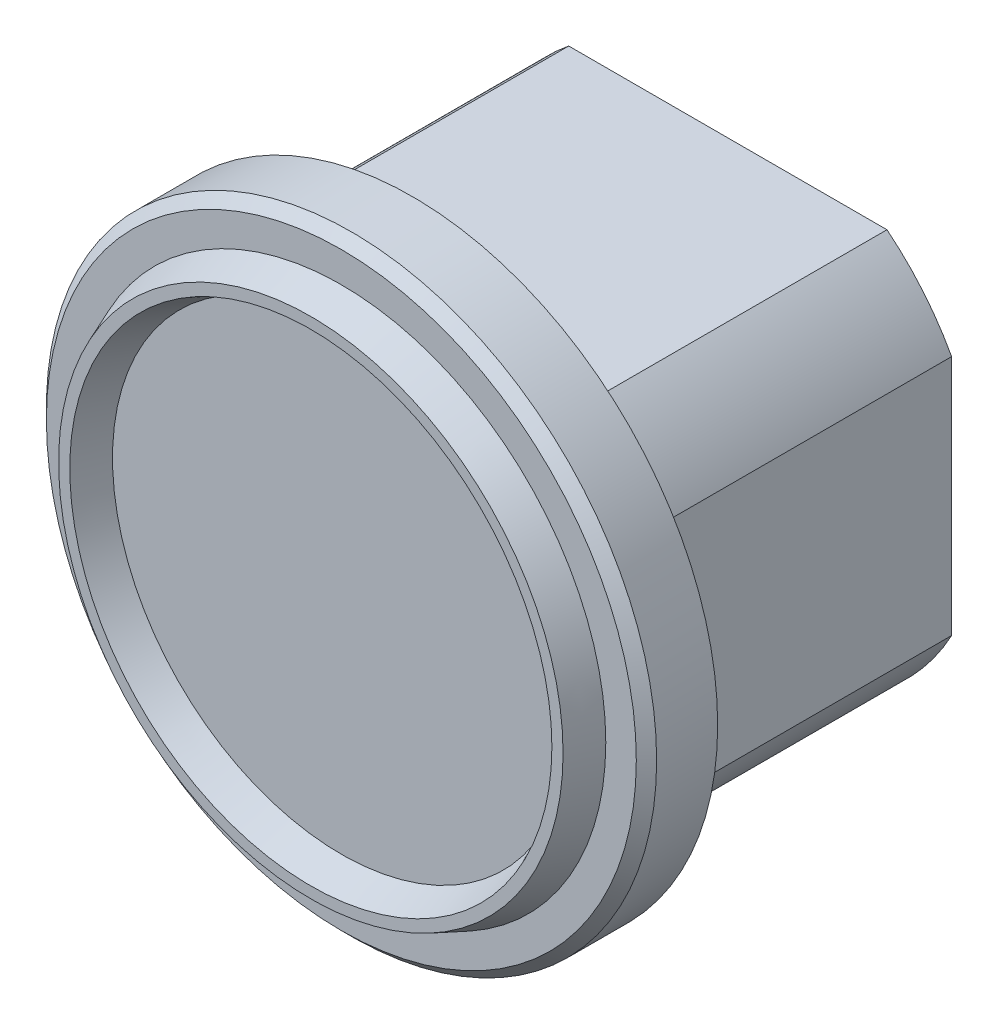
ISO-10303-21;
HEADER;
FILE_DESCRIPTION(('STEP AP214'),'2;1');
FILE_NAME('part.step','',(''),(''),'','','');
FILE_SCHEMA(('AUTOMOTIVE_DESIGN { 1 0 10303 214 1 1 1 1 }'));
ENDSEC;
DATA;
#1=APPLICATION_CONTEXT('core data for automotive mechanical design processes');
#2=APPLICATION_PROTOCOL_DEFINITION('international standard','automotive_design',2000,#1);
#3=PRODUCT_CONTEXT('',#1,'mechanical');
#4=PRODUCT('Part','Part','',(#3));
#5=PRODUCT_RELATED_PRODUCT_CATEGORY('part','',(#4));
#6=PRODUCT_DEFINITION_FORMATION('','',#4);
#7=PRODUCT_DEFINITION_CONTEXT('part definition',#1,'design');
#8=PRODUCT_DEFINITION('design','',#6,#7);
#9=PRODUCT_DEFINITION_SHAPE('','',#8);
#10=(LENGTH_UNIT() NAMED_UNIT(*) SI_UNIT(.MILLI.,.METRE.));
#11=(NAMED_UNIT(*) PLANE_ANGLE_UNIT() SI_UNIT($,.RADIAN.));
#12=(NAMED_UNIT(*) SI_UNIT($,.STERADIAN.) SOLID_ANGLE_UNIT());
#13=UNCERTAINTY_MEASURE_WITH_UNIT(LENGTH_MEASURE(1.E-05),#10,'distance_accuracy_value','');
#14=(GEOMETRIC_REPRESENTATION_CONTEXT(3) GLOBAL_UNCERTAINTY_ASSIGNED_CONTEXT((#13)) GLOBAL_UNIT_ASSIGNED_CONTEXT((#10,
#11,#12)) REPRESENTATION_CONTEXT('',''));
#15=CARTESIAN_POINT('',(0.,0.,0.));
#16=DIRECTION('',(0.,0.,1.));
#17=DIRECTION('',(1.,0.,0.));
#18=AXIS2_PLACEMENT_3D('',#15,#16,#17);
#19=CARTESIAN_POINT('',(22.,19.5,31.));
#20=DIRECTION('',(0.,0.,-1.));
#21=DIRECTION('',(-1.,0.,0.));
#22=AXIS2_PLACEMENT_3D('',#19,#20,#21);
#23=CYLINDRICAL_SURFACE('',#22,25.);
#24=CARTESIAN_POINT('',(22.,19.5,0.));
#25=DIRECTION('',(0.,0.,1.));
#26=DIRECTION('',(1.,0.,0.));
#27=AXIS2_PLACEMENT_3D('',#24,#25,#26);
#28=CIRCLE('',#27,25.);
#29=CARTESIAN_POINT('',(6.35551215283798,39.,0.));
#30=VERTEX_POINT('',#29);
#31=CARTESIAN_POINT('',(0.,31.3743420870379,0.));
#32=VERTEX_POINT('',#31);
#33=EDGE_CURVE('E144',#30,#32,#28,.T.);
#34=ORIENTED_EDGE('',*,*,#33,.T.);
#35=DIRECTION('',(0.,0.,-1.));
#36=VECTOR('',#35,1.);
#37=CARTESIAN_POINT('',(0.,31.3743420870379,31.));
#38=LINE('',#37,#36);
#39=CARTESIAN_POINT('',(0.,31.3743420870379,31.));
#40=VERTEX_POINT('',#39);
#41=EDGE_CURVE('E170',#40,#32,#38,.T.);
#42=ORIENTED_EDGE('',*,*,#41,.F.);
#43=CARTESIAN_POINT('',(22.,19.5,31.));
#44=DIRECTION('',(0.,0.,1.));
#45=DIRECTION('',(1.,0.,0.));
#46=AXIS2_PLACEMENT_3D('',#43,#44,#45);
#47=CIRCLE('',#46,25.);
#48=CARTESIAN_POINT('',(6.35551215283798,39.,31.));
#49=VERTEX_POINT('',#48);
#50=EDGE_CURVE('E159',#49,#40,#47,.T.);
#51=ORIENTED_EDGE('',*,*,#50,.F.);
#52=DIRECTION('',(0.,0.,-1.));
#53=VECTOR('',#52,1.);
#54=CARTESIAN_POINT('',(6.35551215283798,39.,31.));
#55=LINE('',#54,#53);
#56=EDGE_CURVE('E143',#49,#30,#55,.T.);
#57=ORIENTED_EDGE('',*,*,#56,.T.);
#58=EDGE_LOOP('',(#34,#42,#51,#57));
#59=FACE_BOUND('',#58,.T.);
#60=ADVANCED_FACE('F35',(#59),#23,.T.);
#61=CARTESIAN_POINT('',(0.,7.62565791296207,31.));
#62=DIRECTION('',(1.,0.,0.));
#63=DIRECTION('',(0.,0.,-1.));
#64=AXIS2_PLACEMENT_3D('',#61,#62,#63);
#65=PLANE('',#64);
#66=DIRECTION('',(0.,-1.,0.));
#67=VECTOR('',#66,1.);
#68=CARTESIAN_POINT('',(0.,7.62565791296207,0.));
#69=LINE('',#68,#67);
#70=CARTESIAN_POINT('',(0.,7.62565791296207,0.));
#71=VERTEX_POINT('',#70);
#72=EDGE_CURVE('E147',#32,#71,#69,.T.);
#73=ORIENTED_EDGE('',*,*,#72,.T.);
#74=DIRECTION('',(0.,0.,-1.));
#75=VECTOR('',#74,1.);
#76=CARTESIAN_POINT('',(0.,7.62565791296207,31.));
#77=LINE('',#76,#75);
#78=CARTESIAN_POINT('',(0.,7.62565791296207,31.));
#79=VERTEX_POINT('',#78);
#80=EDGE_CURVE('E167',#79,#71,#77,.T.);
#81=ORIENTED_EDGE('',*,*,#80,.F.);
#82=DIRECTION('',(0.,-1.,0.));
#83=VECTOR('',#82,1.);
#84=CARTESIAN_POINT('',(0.,7.62565791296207,31.));
#85=LINE('',#84,#83);
#86=EDGE_CURVE('E95',#40,#79,#85,.T.);
#87=ORIENTED_EDGE('',*,*,#86,.F.);
#88=ORIENTED_EDGE('',*,*,#41,.T.);
#89=EDGE_LOOP('',(#73,#81,#87,#88));
#90=FACE_BOUND('',#89,.T.);
#91=ADVANCED_FACE('F200',(#90),#65,.F.);
#92=CARTESIAN_POINT('',(22.,19.5,31.));
#93=DIRECTION('',(0.,0.,-1.));
#94=DIRECTION('',(-1.,0.,0.));
#95=AXIS2_PLACEMENT_3D('',#92,#93,#94);
#96=CYLINDRICAL_SURFACE('',#95,25.);
#97=CARTESIAN_POINT('',(22.,19.5,0.));
#98=DIRECTION('',(0.,0.,1.));
#99=DIRECTION('',(1.,0.,0.));
#100=AXIS2_PLACEMENT_3D('',#97,#98,#99);
#101=CIRCLE('',#100,25.);
#102=CARTESIAN_POINT('',(6.35551215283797,0.,0.));
#103=VERTEX_POINT('',#102);
#104=EDGE_CURVE('E150',#71,#103,#101,.T.);
#105=ORIENTED_EDGE('',*,*,#104,.T.);
#106=DIRECTION('',(0.,0.,-1.));
#107=VECTOR('',#106,1.);
#108=CARTESIAN_POINT('',(6.35551215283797,0.,31.));
#109=LINE('',#108,#107);
#110=CARTESIAN_POINT('',(6.35551215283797,0.,31.));
#111=VERTEX_POINT('',#110);
#112=EDGE_CURVE('E164',#111,#103,#109,.T.);
#113=ORIENTED_EDGE('',*,*,#112,.F.);
#114=CARTESIAN_POINT('',(22.,19.5,31.));
#115=DIRECTION('',(0.,0.,1.));
#116=DIRECTION('',(1.,0.,0.));
#117=AXIS2_PLACEMENT_3D('',#114,#115,#116);
#118=CIRCLE('',#117,25.);
#119=EDGE_CURVE('E136',#79,#111,#118,.T.);
#120=ORIENTED_EDGE('',*,*,#119,.F.);
#121=ORIENTED_EDGE('',*,*,#80,.T.);
#122=EDGE_LOOP('',(#105,#113,#120,#121));
#123=FACE_BOUND('',#122,.T.);
#124=ADVANCED_FACE('F206',(#123),#96,.T.);
#125=CARTESIAN_POINT('',(6.35551215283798,0.,31.));
#126=DIRECTION('',(0.,1.,0.));
#127=DIRECTION('',(0.,0.,1.));
#128=AXIS2_PLACEMENT_3D('',#125,#126,#127);
#129=PLANE('',#128);
#130=DIRECTION('',(1.,0.,0.));
#131=VECTOR('',#130,1.);
#132=CARTESIAN_POINT('',(6.35551215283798,0.,0.));
#133=LINE('',#132,#131);
#134=CARTESIAN_POINT('',(37.644487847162,0.,0.));
#135=VERTEX_POINT('',#134);
#136=EDGE_CURVE('E152',#103,#135,#133,.T.);
#137=ORIENTED_EDGE('',*,*,#136,.T.);
#138=DIRECTION('',(0.,0.,-1.));
#139=VECTOR('',#138,1.);
#140=CARTESIAN_POINT('',(37.644487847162,0.,31.));
#141=LINE('',#140,#139);
#142=CARTESIAN_POINT('',(37.644487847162,0.,31.));
#143=VERTEX_POINT('',#142);
#144=EDGE_CURVE('E120',#143,#135,#141,.T.);
#145=ORIENTED_EDGE('',*,*,#144,.F.);
#146=DIRECTION('',(1.,0.,0.));
#147=VECTOR('',#146,1.);
#148=CARTESIAN_POINT('',(6.35551215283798,0.,31.));
#149=LINE('',#148,#147);
#150=EDGE_CURVE('E134',#111,#143,#149,.T.);
#151=ORIENTED_EDGE('',*,*,#150,.F.);
#152=ORIENTED_EDGE('',*,*,#112,.T.);
#153=EDGE_LOOP('',(#137,#145,#151,#152));
#154=FACE_BOUND('',#153,.T.);
#155=ADVANCED_FACE('F242',(#154),#129,.F.);
#156=CARTESIAN_POINT('',(22.,19.5,31.));
#157=DIRECTION('',(0.,0.,-1.));
#158=DIRECTION('',(-1.,0.,0.));
#159=AXIS2_PLACEMENT_3D('',#156,#157,#158);
#160=CYLINDRICAL_SURFACE('',#159,25.);
#161=CARTESIAN_POINT('',(22.,19.5,0.));
#162=DIRECTION('',(0.,0.,1.));
#163=DIRECTION('',(1.,0.,0.));
#164=AXIS2_PLACEMENT_3D('',#161,#162,#163);
#165=CIRCLE('',#164,25.);
#166=CARTESIAN_POINT('',(44.,7.62565791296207,0.));
#167=VERTEX_POINT('',#166);
#168=EDGE_CURVE('E117',#135,#167,#165,.T.);
#169=ORIENTED_EDGE('',*,*,#168,.T.);
#170=DIRECTION('',(0.,0.,-1.));
#171=VECTOR('',#170,1.);
#172=CARTESIAN_POINT('',(44.,7.62565791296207,31.));
#173=LINE('',#172,#171);
#174=CARTESIAN_POINT('',(44.,7.62565791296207,31.));
#175=VERTEX_POINT('',#174);
#176=EDGE_CURVE('E109',#175,#167,#173,.T.);
#177=ORIENTED_EDGE('',*,*,#176,.F.);
#178=CARTESIAN_POINT('',(22.,19.5,31.));
#179=DIRECTION('',(0.,0.,1.));
#180=DIRECTION('',(1.,0.,0.));
#181=AXIS2_PLACEMENT_3D('',#178,#179,#180);
#182=CIRCLE('',#181,25.);
#183=EDGE_CURVE('E114',#143,#175,#182,.T.);
#184=ORIENTED_EDGE('',*,*,#183,.F.);
#185=ORIENTED_EDGE('',*,*,#144,.T.);
#186=EDGE_LOOP('',(#169,#177,#184,#185));
#187=FACE_BOUND('',#186,.T.);
#188=ADVANCED_FACE('F111',(#187),#160,.T.);
#189=CARTESIAN_POINT('',(44.,7.62565791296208,31.));
#190=DIRECTION('',(-1.,0.,0.));
#191=DIRECTION('',(0.,0.,1.));
#192=AXIS2_PLACEMENT_3D('',#189,#190,#191);
#193=PLANE('',#192);
#194=DIRECTION('',(0.,1.,0.));
#195=VECTOR('',#194,1.);
#196=CARTESIAN_POINT('',(44.,7.62565791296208,0.));
#197=LINE('',#196,#195);
#198=CARTESIAN_POINT('',(44.,31.3743420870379,0.));
#199=VERTEX_POINT('',#198);
#200=EDGE_CURVE('E155',#167,#199,#197,.T.);
#201=ORIENTED_EDGE('',*,*,#200,.T.);
#202=DIRECTION('',(0.,0.,-1.));
#203=VECTOR('',#202,1.);
#204=CARTESIAN_POINT('',(44.,31.3743420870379,31.));
#205=LINE('',#204,#203);
#206=CARTESIAN_POINT('',(44.,31.3743420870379,31.));
#207=VERTEX_POINT('',#206);
#208=EDGE_CURVE('E121',#207,#199,#205,.T.);
#209=ORIENTED_EDGE('',*,*,#208,.F.);
#210=DIRECTION('',(0.,1.,0.));
#211=VECTOR('',#210,1.);
#212=CARTESIAN_POINT('',(44.,7.62565791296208,31.));
#213=LINE('',#212,#211);
#214=EDGE_CURVE('E124',#175,#207,#213,.T.);
#215=ORIENTED_EDGE('',*,*,#214,.F.);
#216=ORIENTED_EDGE('',*,*,#176,.T.);
#217=EDGE_LOOP('',(#201,#209,#215,#216));
#218=FACE_BOUND('',#217,.T.);
#219=ADVANCED_FACE('F125',(#218),#193,.F.);
#220=CARTESIAN_POINT('',(22.,19.5,31.));
#221=DIRECTION('',(0.,0.,-1.));
#222=DIRECTION('',(-1.,0.,0.));
#223=AXIS2_PLACEMENT_3D('',#220,#221,#222);
#224=CYLINDRICAL_SURFACE('',#223,25.);
#225=CARTESIAN_POINT('',(22.,19.5,0.));
#226=DIRECTION('',(0.,0.,1.));
#227=DIRECTION('',(1.,0.,0.));
#228=AXIS2_PLACEMENT_3D('',#225,#226,#227);
#229=CIRCLE('',#228,25.);
#230=CARTESIAN_POINT('',(37.644487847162,39.,0.));
#231=VERTEX_POINT('',#230);
#232=EDGE_CURVE('E80',#199,#231,#229,.T.);
#233=ORIENTED_EDGE('',*,*,#232,.T.);
#234=DIRECTION('',(0.,0.,-1.));
#235=VECTOR('',#234,1.);
#236=CARTESIAN_POINT('',(37.644487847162,39.,31.));
#237=LINE('',#236,#235);
#238=CARTESIAN_POINT('',(37.644487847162,39.,31.));
#239=VERTEX_POINT('',#238);
#240=EDGE_CURVE('E52',#239,#231,#237,.T.);
#241=ORIENTED_EDGE('',*,*,#240,.F.);
#242=CARTESIAN_POINT('',(22.,19.5,31.));
#243=DIRECTION('',(0.,0.,1.));
#244=DIRECTION('',(1.,0.,0.));
#245=AXIS2_PLACEMENT_3D('',#242,#243,#244);
#246=CIRCLE('',#245,25.);
#247=EDGE_CURVE('E128',#207,#239,#246,.T.);
#248=ORIENTED_EDGE('',*,*,#247,.F.);
#249=ORIENTED_EDGE('',*,*,#208,.T.);
#250=EDGE_LOOP('',(#233,#241,#248,#249));
#251=FACE_BOUND('',#250,.T.);
#252=ADVANCED_FACE('F246',(#251),#224,.T.);
#253=CARTESIAN_POINT('',(6.35551215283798,39.,31.));
#254=DIRECTION('',(0.,-1.,0.));
#255=DIRECTION('',(1.,0.,0.));
#256=AXIS2_PLACEMENT_3D('',#253,#254,#255);
#257=PLANE('',#256);
#258=DIRECTION('',(-1.,0.,0.));
#259=VECTOR('',#258,1.);
#260=CARTESIAN_POINT('',(6.35551215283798,39.,0.));
#261=LINE('',#260,#259);
#262=EDGE_CURVE('E86',#231,#30,#261,.T.);
#263=ORIENTED_EDGE('',*,*,#262,.T.);
#264=ORIENTED_EDGE('',*,*,#56,.F.);
#265=DIRECTION('',(-1.,0.,0.));
#266=VECTOR('',#265,1.);
#267=CARTESIAN_POINT('',(6.35551215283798,39.,31.));
#268=LINE('',#267,#266);
#269=EDGE_CURVE('E141',#239,#49,#268,.T.);
#270=ORIENTED_EDGE('',*,*,#269,.F.);
#271=ORIENTED_EDGE('',*,*,#240,.T.);
#272=EDGE_LOOP('',(#263,#264,#270,#271));
#273=FACE_BOUND('',#272,.T.);
#274=ADVANCED_FACE('F248',(#273),#257,.F.);
#275=CARTESIAN_POINT('',(22.,19.5,0.));
#276=DIRECTION('',(0.,0.,1.));
#277=DIRECTION('',(1.,0.,0.));
#278=AXIS2_PLACEMENT_3D('',#275,#276,#277);
#279=PLANE('',#278);
#280=ORIENTED_EDGE('',*,*,#33,.F.);
#281=ORIENTED_EDGE('',*,*,#262,.F.);
#282=ORIENTED_EDGE('',*,*,#232,.F.);
#283=ORIENTED_EDGE('',*,*,#200,.F.);
#284=ORIENTED_EDGE('',*,*,#168,.F.);
#285=ORIENTED_EDGE('',*,*,#136,.F.);
#286=ORIENTED_EDGE('',*,*,#104,.F.);
#287=ORIENTED_EDGE('',*,*,#72,.F.);
#288=EDGE_LOOP('',(#280,#281,#282,#283,#284,#285,#286,#287));
#289=FACE_BOUND('',#288,.T.);
#290=ADVANCED_FACE('F245',(#289),#279,.F.);
#291=CARTESIAN_POINT('',(22.,19.5,31.));
#292=DIRECTION('',(0.,0.,1.));
#293=DIRECTION('',(1.,0.,0.));
#294=AXIS2_PLACEMENT_3D('',#291,#292,#293);
#295=PLANE('',#294);
#296=CARTESIAN_POINT('',(22.,19.5,31.));
#297=DIRECTION('',(0.,0.,1.));
#298=DIRECTION('',(1.,0.,0.));
#299=AXIS2_PLACEMENT_3D('',#296,#297,#298);
#300=CIRCLE('',#299,30.);
#301=CARTESIAN_POINT('',(52.,19.5,31.));
#302=VERTEX_POINT('',#301);
#303=EDGE_CURVE('E148',#302,#302,#300,.T.);
#304=ORIENTED_EDGE('',*,*,#303,.F.);
#305=EDGE_LOOP('',(#304));
#306=FACE_BOUND('',#305,.T.);
#307=ORIENTED_EDGE('',*,*,#269,.T.);
#308=ORIENTED_EDGE('',*,*,#50,.T.);
#309=ORIENTED_EDGE('',*,*,#86,.T.);
#310=ORIENTED_EDGE('',*,*,#119,.T.);
#311=ORIENTED_EDGE('',*,*,#150,.T.);
#312=ORIENTED_EDGE('',*,*,#183,.T.);
#313=ORIENTED_EDGE('',*,*,#214,.T.);
#314=ORIENTED_EDGE('',*,*,#247,.T.);
#315=EDGE_LOOP('',(#307,#308,#309,#310,#311,#312,#313,#314));
#316=FACE_BOUND('',#315,.T.);
#317=ADVANCED_FACE('F131',(#306,#316),#295,.F.);
#318=CARTESIAN_POINT('',(22.,19.5,38.));
#319=DIRECTION('',(0.,0.,-1.));
#320=DIRECTION('',(-1.,0.,0.));
#321=AXIS2_PLACEMENT_3D('',#318,#319,#320);
#322=CYLINDRICAL_SURFACE('',#321,30.);
#323=CARTESIAN_POINT('',(22.,19.5,37.));
#324=DIRECTION('',(0.,0.,1.));
#325=DIRECTION('',(1.,0.,0.));
#326=AXIS2_PLACEMENT_3D('',#323,#324,#325);
#327=CIRCLE('',#326,30.);
#328=CARTESIAN_POINT('',(52.,19.5,37.));
#329=VERTEX_POINT('',#328);
#330=EDGE_CURVE('E175',#329,#329,#327,.F.);
#331=ORIENTED_EDGE('',*,*,#330,.T.);
#332=EDGE_LOOP('',(#331));
#333=FACE_BOUND('',#332,.T.);
#334=ORIENTED_EDGE('',*,*,#303,.T.);
#335=EDGE_LOOP('',(#334));
#336=FACE_BOUND('',#335,.T.);
#337=ADVANCED_FACE('F218',(#333,#336),#322,.T.);
#338=CARTESIAN_POINT('',(22.,19.5,38.));
#339=DIRECTION('',(0.,0.,1.));
#340=DIRECTION('',(1.,0.,0.));
#341=AXIS2_PLACEMENT_3D('',#338,#339,#340);
#342=PLANE('',#341);
#343=CARTESIAN_POINT('',(22.,19.5,38.));
#344=DIRECTION('',(0.,0.,1.));
#345=DIRECTION('',(1.,0.,0.));
#346=AXIS2_PLACEMENT_3D('',#343,#344,#345);
#347=CIRCLE('',#346,26.);
#348=CARTESIAN_POINT('',(48.,19.5,38.));
#349=VERTEX_POINT('',#348);
#350=EDGE_CURVE('E231',#349,#349,#347,.T.);
#351=ORIENTED_EDGE('',*,*,#350,.F.);
#352=EDGE_LOOP('',(#351));
#353=FACE_BOUND('',#352,.T.);
#354=CARTESIAN_POINT('',(22.,19.5,38.));
#355=DIRECTION('',(0.,0.,1.));
#356=DIRECTION('',(1.,0.,0.));
#357=AXIS2_PLACEMENT_3D('',#354,#355,#356);
#358=CIRCLE('',#357,29.);
#359=CARTESIAN_POINT('',(51.,19.5,38.));
#360=VERTEX_POINT('',#359);
#361=EDGE_CURVE('E172',#360,#360,#358,.T.);
#362=ORIENTED_EDGE('',*,*,#361,.T.);
#363=EDGE_LOOP('',(#362));
#364=FACE_BOUND('',#363,.T.);
#365=ADVANCED_FACE('F196',(#353,#364),#342,.T.);
#366=CARTESIAN_POINT('',(22.,19.5,38.));
#367=DIRECTION('',(0.,0.,-1.));
#368=DIRECTION('',(-1.,0.,0.));
#369=AXIS2_PLACEMENT_3D('',#366,#367,#368);
#370=CONICAL_SURFACE('',#369,29.,0.78539816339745);
#371=ORIENTED_EDGE('',*,*,#330,.F.);
#372=EDGE_LOOP('',(#371));
#373=FACE_BOUND('',#372,.T.);
#374=ORIENTED_EDGE('',*,*,#361,.F.);
#375=EDGE_LOOP('',(#374));
#376=FACE_BOUND('',#375,.T.);
#377=ADVANCED_FACE('F209',(#373,#376),#370,.T.);
#378=CARTESIAN_POINT('',(22.,19.5,41.));
#379=DIRECTION('',(0.,0.,1.));
#380=DIRECTION('',(1.,0.,0.));
#381=AXIS2_PLACEMENT_3D('',#378,#379,#380);
#382=PLANE('',#381);
#383=CARTESIAN_POINT('',(22.,19.5,41.));
#384=DIRECTION('',(0.,0.,1.));
#385=DIRECTION('',(1.,0.,0.));
#386=AXIS2_PLACEMENT_3D('',#383,#384,#385);
#387=CIRCLE('',#386,23.7);
#388=CARTESIAN_POINT('',(45.7,19.5,41.));
#389=VERTEX_POINT('',#388);
#390=EDGE_CURVE('E11',#389,#389,#387,.F.);
#391=ORIENTED_EDGE('',*,*,#390,.T.);
#392=EDGE_LOOP('',(#391));
#393=FACE_BOUND('',#392,.T.);
#394=CARTESIAN_POINT('',(22.,19.5,41.));
#395=DIRECTION('',(0.,0.,1.));
#396=DIRECTION('',(1.,0.,0.));
#397=AXIS2_PLACEMENT_3D('',#394,#395,#396);
#398=CIRCLE('',#397,24.8);
#399=CARTESIAN_POINT('',(46.8,19.5,41.));
#400=VERTEX_POINT('',#399);
#401=EDGE_CURVE('E44',#400,#400,#398,.T.);
#402=ORIENTED_EDGE('',*,*,#401,.T.);
#403=EDGE_LOOP('',(#402));
#404=FACE_BOUND('',#403,.T.);
#405=ADVANCED_FACE('F183',(#393,#404),#382,.T.);
#406=CARTESIAN_POINT('',(22.,19.5,38.));
#407=DIRECTION('',(0.,0.,1.));
#408=DIRECTION('',(1.,0.,0.));
#409=AXIS2_PLACEMENT_3D('',#406,#407,#408);
#410=CIRCLE('',#409,22.5);
#411=CARTESIAN_POINT('',(44.5,19.5,38.));
#412=VERTEX_POINT('',#411);
#413=EDGE_CURVE('E178',#412,#412,#410,.F.);
#414=ORIENTED_EDGE('',*,*,#413,.F.);
#415=EDGE_LOOP('',(#414));
#416=FACE_BOUND('',#415,.T.);
#417=ADVANCED_FACE('F187',(#416),#342,.T.);
#418=CARTESIAN_POINT('',(22.,19.5,41.));
#419=DIRECTION('',(0.,0.,-1.));
#420=DIRECTION('',(-1.,0.,0.));
#421=AXIS2_PLACEMENT_3D('',#418,#419,#420);
#422=CONICAL_SURFACE('',#421,24.8,0.38050637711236);
#423=ORIENTED_EDGE('',*,*,#350,.T.);
#424=EDGE_LOOP('',(#423));
#425=FACE_BOUND('',#424,.T.);
#426=ORIENTED_EDGE('',*,*,#401,.F.);
#427=EDGE_LOOP('',(#426));
#428=FACE_BOUND('',#427,.T.);
#429=ADVANCED_FACE('F185',(#425,#428),#422,.T.);
#430=CARTESIAN_POINT('',(22.,19.5,38.));
#431=DIRECTION('',(0.,0.,1.));
#432=DIRECTION('',(1.,0.,0.));
#433=AXIS2_PLACEMENT_3D('',#430,#431,#432);
#434=CONICAL_SURFACE('',#433,22.5,0.380506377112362);
#435=CARTESIAN_POINT('',(45.7,19.5,41.));
#436=CARTESIAN_POINT('',(45.6875,19.5,40.96875));
#437=CARTESIAN_POINT('',(45.675,19.5,40.9375));
#438=CARTESIAN_POINT('',(45.65,19.5,40.875));
#439=CARTESIAN_POINT('',(45.6375,19.5,40.84375));
#440=CARTESIAN_POINT('',(45.6125,19.5,40.78125));
#441=CARTESIAN_POINT('',(45.6,19.5,40.75));
#442=CARTESIAN_POINT('',(45.575,19.5,40.6875));
#443=CARTESIAN_POINT('',(45.5625,19.5,40.65625));
#444=CARTESIAN_POINT('',(45.5375,19.5,40.59375));
#445=CARTESIAN_POINT('',(45.525,19.5,40.5625));
#446=CARTESIAN_POINT('',(45.5,19.5,40.5));
#447=CARTESIAN_POINT('',(45.4875,19.5,40.46875));
#448=CARTESIAN_POINT('',(45.4625,19.5,40.40625));
#449=CARTESIAN_POINT('',(45.45,19.5,40.375));
#450=CARTESIAN_POINT('',(45.425,19.5,40.3125));
#451=CARTESIAN_POINT('',(45.4125,19.5,40.28125));
#452=CARTESIAN_POINT('',(45.3875,19.5,40.21875));
#453=CARTESIAN_POINT('',(45.375,19.5,40.1875));
#454=CARTESIAN_POINT('',(45.35,19.5,40.125));
#455=CARTESIAN_POINT('',(45.3375,19.5,40.09375));
#456=CARTESIAN_POINT('',(45.3125,19.5,40.03125));
#457=CARTESIAN_POINT('',(45.3,19.5,40.));
#458=CARTESIAN_POINT('',(45.275,19.5,39.9375));
#459=CARTESIAN_POINT('',(45.2625,19.5,39.90625));
#460=CARTESIAN_POINT('',(45.2375,19.5,39.84375));
#461=CARTESIAN_POINT('',(45.225,19.5,39.8125));
#462=CARTESIAN_POINT('',(45.2,19.5,39.75));
#463=CARTESIAN_POINT('',(45.1875,19.5,39.71875));
#464=CARTESIAN_POINT('',(45.1625,19.5,39.65625));
#465=CARTESIAN_POINT('',(45.15,19.5,39.625));
#466=CARTESIAN_POINT('',(45.125,19.5,39.5625));
#467=CARTESIAN_POINT('',(45.1125,19.5,39.53125));
#468=CARTESIAN_POINT('',(45.0875,19.5,39.46875));
#469=CARTESIAN_POINT('',(45.075,19.5,39.4375));
#470=CARTESIAN_POINT('',(45.05,19.5,39.375));
#471=CARTESIAN_POINT('',(45.0375,19.5,39.34375));
#472=CARTESIAN_POINT('',(45.0125,19.5,39.28125));
#473=CARTESIAN_POINT('',(45.,19.5,39.25));
#474=CARTESIAN_POINT('',(44.975,19.5,39.1875));
#475=CARTESIAN_POINT('',(44.9625,19.5,39.15625));
#476=CARTESIAN_POINT('',(44.9375,19.5,39.09375));
#477=CARTESIAN_POINT('',(44.925,19.5,39.0625));
#478=CARTESIAN_POINT('',(44.9,19.5,39.));
#479=CARTESIAN_POINT('',(44.8875,19.5,38.96875));
#480=CARTESIAN_POINT('',(44.8625,19.5,38.90625));
#481=CARTESIAN_POINT('',(44.85,19.5,38.875));
#482=CARTESIAN_POINT('',(44.825,19.5,38.8125));
#483=CARTESIAN_POINT('',(44.8125,19.5,38.78125));
#484=CARTESIAN_POINT('',(44.7875,19.5,38.71875));
#485=CARTESIAN_POINT('',(44.775,19.5,38.6875));
#486=CARTESIAN_POINT('',(44.75,19.5,38.625));
#487=CARTESIAN_POINT('',(44.7375,19.5,38.59375));
#488=CARTESIAN_POINT('',(44.7125,19.5,38.53125));
#489=CARTESIAN_POINT('',(44.7,19.5,38.5));
#490=CARTESIAN_POINT('',(44.675,19.5,38.4375));
#491=CARTESIAN_POINT('',(44.6625,19.5,38.40625));
#492=CARTESIAN_POINT('',(44.6375,19.5,38.34375));
#493=CARTESIAN_POINT('',(44.625,19.5,38.3125));
#494=CARTESIAN_POINT('',(44.6,19.5,38.25));
#495=CARTESIAN_POINT('',(44.5875,19.5,38.21875));
#496=CARTESIAN_POINT('',(44.5625,19.5,38.15625));
#497=CARTESIAN_POINT('',(44.55,19.5,38.125));
#498=CARTESIAN_POINT('',(44.525,19.5,38.0625));
#499=CARTESIAN_POINT('',(44.5125,19.5,38.03125));
#500=CARTESIAN_POINT('',(44.5,19.5,38.));
#501=B_SPLINE_CURVE_WITH_KNOTS('',3,(#435,#436,#437,#438,#439,#440,#441,#442,#443,#444,#445,
#446,#447,#448,#449,#450,#451,#452,#453,#454,#455,#456,#457,#458,#459,#460,#461,#462,#463,#464,
#465,#466,#467,#468,#469,#470,#471,#472,#473,#474,#475,#476,#477,#478,#479,#480,#481,#482,#483,
#484,#485,#486,#487,#488,#489,#490,#491,#492,#493,#494,#495,#496,#497,#498,#499,#500),
.UNSPECIFIED.,.F.,.F.,(4,2,2,2,2,2,2,2,2,2,2,2,2,2,2,2,2,2,2,2,2,2,2,2,2,2,2,2,2,2,2,2,4),(0.,
0.100971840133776,0.201943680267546,0.30291552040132,0.40388736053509,0.504859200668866,
0.605831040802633,0.706802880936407,0.807774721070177,0.908746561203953,1.00971840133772,
1.1106902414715,1.21166208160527,1.31263392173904,1.41360576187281,1.51457760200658,
1.61554944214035,1.71652128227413,1.8174931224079,1.91846496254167,2.01943680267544,
2.12040864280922,2.22138048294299,2.32235232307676,2.42332416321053,2.5242960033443,
2.62526784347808,2.72623968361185,2.82721152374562,2.92818336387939,3.02915520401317,
3.13012704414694,3.23109888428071),.UNSPECIFIED.);
#502=EDGE_CURVE('BSEAM37',#389,#412,#501,.T.);
#503=ORIENTED_EDGE('',*,*,#390,.F.);
#504=ORIENTED_EDGE('',*,*,#413,.T.);
#505=ORIENTED_EDGE('',*,*,#502,.T.);
#506=ORIENTED_EDGE('',*,*,#502,.F.);
#507=EDGE_LOOP('',(#503,#505,#504,#506));
#508=FACE_BOUND('',#507,.T.);
#509=ADVANCED_FACE('F37',(#508),#434,.F.);
#510=CLOSED_SHELL('',(#60,#91,#124,#155,#188,#219,#252,#274,#290,#317,#337,#365,#377,#405,#417,
#429,#509));
#511=MANIFOLD_SOLID_BREP('B2',#510);
#512=ADVANCED_BREP_SHAPE_REPRESENTATION('',(#18,#511),#14);
#513=SHAPE_DEFINITION_REPRESENTATION(#9,#512);
ENDSEC;
END-ISO-10303-21;
